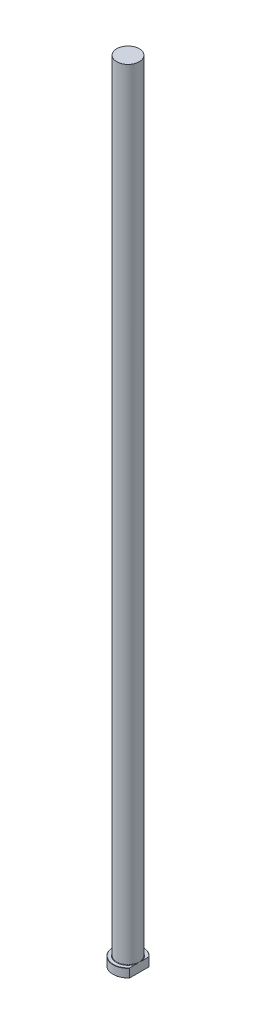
from build123d import *
from build123d.topology import SkipClean

# Parameters (mm, degrees)
CHAMFER1_SIZE = 0.2
FILLET1_R     = 0.3
KEY_DEPTH     = 631.228529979


with BuildPart() as part:
    # Sketch1 → Revolve1 (revolve)
    with BuildSketch(Plane.XY, mode=Mode.PRIVATE) as revolve1_sk:
        Polygon((0, 0), (-12, 0), (-12, 7), (-9, 7), (-9, 630), (0, 630), align=None)
    revolve(revolve1_sk.sketch.rotate(Axis((0, 259.958771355, 0), (0, -1, 0)), 270), axis=Axis((0, 259.958771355, 0), (0, -1, 0)))

    # Chamfer1
    chamfer1_edges = [part.edges().sort_by_distance(p)[0] for p in [
        (0, 7, -12),
        (0, 0, -12),
    ]]
    chamfer(chamfer1_edges, length=CHAMFER1_SIZE)

    # Fillet1
    fillet1_edges = [part.edges().sort_by_distance(p)[0] for p in [
        (0, 7, -9),
    ]]
    fillet(fillet1_edges, radius=FILLET1_R)

    # Sketch2 → KEY (cut, through all)
    with SkipClean():  # the faces are left unmerged after this step: merging them gives an invalid solid
        with BuildSketch(Plane(origin=(0, 0, 0), x_dir=(1, 0, 0), z_dir=(0, 1, 0))):
            with BuildLine():
                Line((9, 7.937253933), (9, -7.937253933))
                ThreePointArc((9, -7.937253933), (12, 0), (9, 7.937253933))
            make_face()
        extrude(amount=KEY_DEPTH, mode=Mode.SUBTRACT)


solid = part.part
